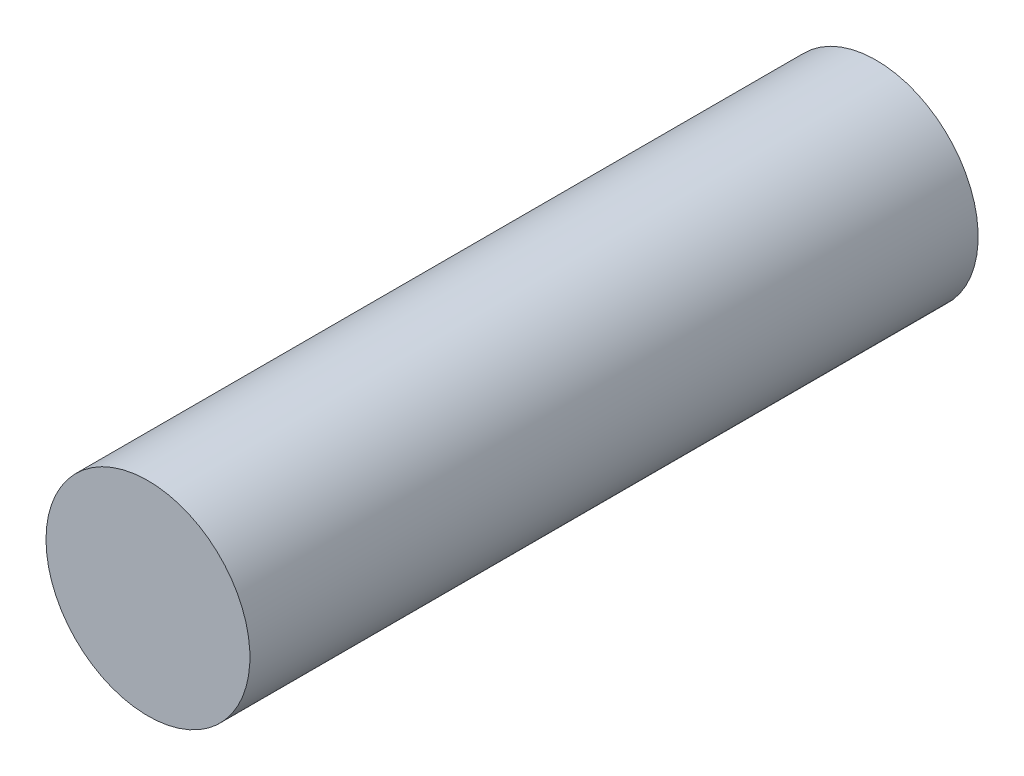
from build123d import *

# Parameters (mm, degrees)
SKETCH1_R      = 10.668
EXTRUDE1_DEPTH = 76.2


with BuildPart() as part:
    # Sketch1 → Extrude1 (new body)
    with BuildSketch(Plane.XY):
        with Locations(Location((0, 0, 0), (0, 0, 180))):
            Circle(SKETCH1_R)
    extrude(amount=EXTRUDE1_DEPTH)


solid = part.part
